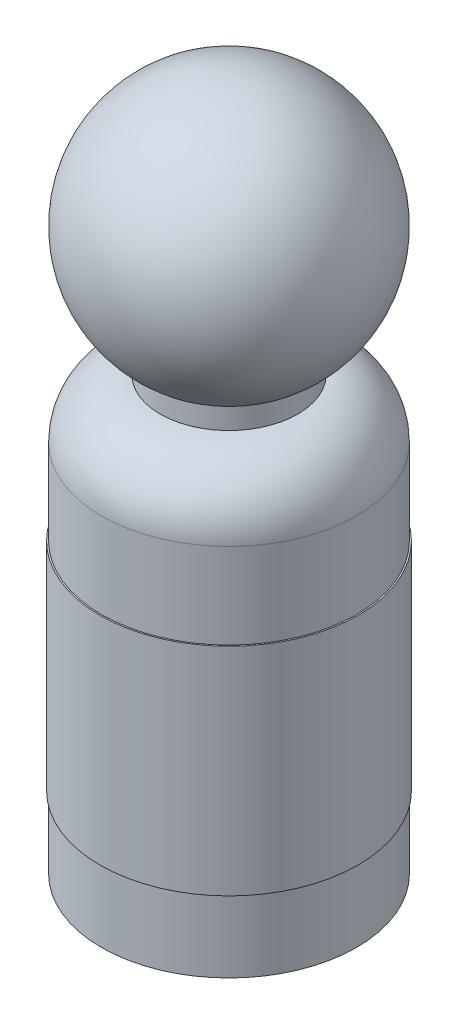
from build123d import *

# Parameters (mm, degrees)
SKETCH1_R           = 11.2395
BOSS_EXTRUDE1_DEPTH = 38.1
FILLET1_R           = 5.1816
SKETCH3_R           = 6.0579
BOSS_EXTRUDE2_DEPTH = 1.8415
SKETCH7_R           = 11.3665
SKETCH7_R_2         = 11.2395
BOSS_EXTRUDE3_DEPTH = 19.05


with BuildPart() as part:
    # Sketch1 → Boss-Extrude1 (new body)
    with BuildSketch(Plane(origin=(0, 0, 0), x_dir=(1, 0, 0), z_dir=(0, 1, 0))):
        with Locations(Location((0, 0, 0), (0, 0, 90))):
            Circle(SKETCH1_R)
    extrude(amount=BOSS_EXTRUDE1_DEPTH)

    # Fillet1
    fillet1_edges = [part.edges().sort_by_distance(p)[0] for p in [
        (0, 38.1, 11.2395),
    ]]
    fillet(fillet1_edges, radius=FILLET1_R)

    # Sketch3 → Boss-Extrude2 (add)
    with BuildSketch(Plane(origin=(0, 38.1, 0), x_dir=(1, 0, 0), z_dir=(0, 1, 0))):
        with Locations(Location((0, 0, 0), (0, 0, 270))):
            Circle(SKETCH3_R)
    extrude(amount=BOSS_EXTRUDE2_DEPTH)

    # Sketch6 → Revolve4 (revolve)
    with BuildSketch(Plane.XY, mode=Mode.PRIVATE) as revolve4_sk:
        with BuildLine():
            Line((-6.0579, 39.9415), (0, 39.9415))
            Line((0, 39.9415), (0, 60.648217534))
            ThreePointArc((0, 60.648217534), (-10.787334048, 52.564630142), (-6.0579, 39.9415))
        make_face()
    revolve(revolve4_sk.sketch.rotate(Axis((0, 60.648217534, 0), (0, -1, 0)), 270), axis=Axis((0, 60.648217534, 0), (0, -1, 0)))

    # Sketch7 → Boss-Extrude3 (add)
    with BuildSketch(Plane(origin=(0, 6.35, 0), x_dir=(-1, 0, 0), z_dir=(0, -1, 0))):
        with Locations(Location((0, 0, 0), (0, 0, 90))):
            Circle(SKETCH7_R)
        with Locations(Location((0, 0, 0), (0, 0, 90))):
            Circle(SKETCH7_R_2, mode=Mode.SUBTRACT)
    extrude(amount=-BOSS_EXTRUDE3_DEPTH)


solid = part.part
